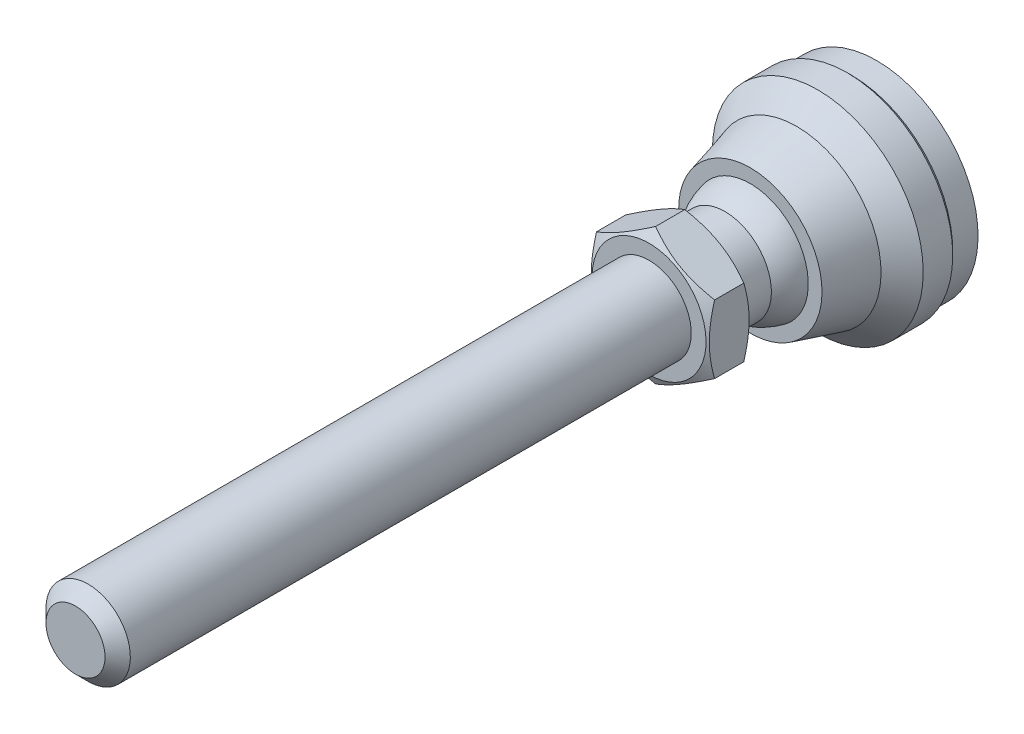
ISO-10303-21;
HEADER;
FILE_DESCRIPTION(('STEP AP214'),'2;1');
FILE_NAME('part.step','',(''),(''),'','','');
FILE_SCHEMA(('AUTOMOTIVE_DESIGN { 1 0 10303 214 1 1 1 1 }'));
ENDSEC;
DATA;
#1=APPLICATION_CONTEXT('core data for automotive mechanical design processes');
#2=APPLICATION_PROTOCOL_DEFINITION('international standard','automotive_design',2000,#1);
#3=PRODUCT_CONTEXT('',#1,'mechanical');
#4=PRODUCT('Part','Part','',(#3));
#5=PRODUCT_RELATED_PRODUCT_CATEGORY('part','',(#4));
#6=PRODUCT_DEFINITION_FORMATION('','',#4);
#7=PRODUCT_DEFINITION_CONTEXT('part definition',#1,'design');
#8=PRODUCT_DEFINITION('design','',#6,#7);
#9=PRODUCT_DEFINITION_SHAPE('','',#8);
#10=(LENGTH_UNIT() NAMED_UNIT(*) SI_UNIT(.MILLI.,.METRE.));
#11=(NAMED_UNIT(*) PLANE_ANGLE_UNIT() SI_UNIT($,.RADIAN.));
#12=(NAMED_UNIT(*) SI_UNIT($,.STERADIAN.) SOLID_ANGLE_UNIT());
#13=UNCERTAINTY_MEASURE_WITH_UNIT(LENGTH_MEASURE(1.E-05),#10,'distance_accuracy_value','');
#14=(GEOMETRIC_REPRESENTATION_CONTEXT(3) GLOBAL_UNCERTAINTY_ASSIGNED_CONTEXT((#13)) GLOBAL_UNIT_ASSIGNED_CONTEXT((#10,
#11,#12)) REPRESENTATION_CONTEXT('',''));
#15=CARTESIAN_POINT('',(0.,0.,0.));
#16=DIRECTION('',(0.,0.,1.));
#17=DIRECTION('',(1.,0.,0.));
#18=AXIS2_PLACEMENT_3D('',#15,#16,#17);
#19=CARTESIAN_POINT('',(-5.49999999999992,0.,21.9999999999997));
#20=DIRECTION('',(0.,0.,1.));
#21=DIRECTION('',(0.,-1.,0.));
#22=AXIS2_PLACEMENT_3D('',#19,#20,#21);
#23=PLANE('',#22);
#24=CARTESIAN_POINT('',(0.,0.,21.9999999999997));
#25=DIRECTION('',(0.,0.,1.));
#26=DIRECTION('',(0.,-1.,0.));
#27=AXIS2_PLACEMENT_3D('',#24,#25,#26);
#28=CIRCLE('',#27,6.75);
#29=CARTESIAN_POINT('',(0.,-6.75,21.9999999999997));
#30=VERTEX_POINT('',#29);
#31=EDGE_CURVE('E440',#30,#30,#28,.T.);
#32=ORIENTED_EDGE('',*,*,#31,.F.);
#33=EDGE_LOOP('',(#32));
#34=FACE_BOUND('',#33,.T.);
#35=CARTESIAN_POINT('',(0.,0.,21.9999999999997));
#36=DIRECTION('',(0.,0.,-1.));
#37=DIRECTION('',(0.,1.,0.));
#38=AXIS2_PLACEMENT_3D('',#35,#36,#37);
#39=CIRCLE('',#38,5.49999999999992);
#40=CARTESIAN_POINT('',(0.,5.49999999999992,21.9999999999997));
#41=VERTEX_POINT('',#40);
#42=EDGE_CURVE('E120',#41,#41,#39,.T.);
#43=ORIENTED_EDGE('',*,*,#42,.F.);
#44=EDGE_LOOP('',(#43));
#45=FACE_BOUND('',#44,.T.);
#46=ADVANCED_FACE('F14',(#34,#45),#23,.F.);
#47=CARTESIAN_POINT('',(0.,0.,0.));
#48=DIRECTION('',(0.,0.,-1.));
#49=DIRECTION('',(0.,1.,0.));
#50=AXIS2_PLACEMENT_3D('',#47,#48,#49);
#51=CYLINDRICAL_SURFACE('',#50,5.49999999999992);
#52=CARTESIAN_POINT('',(0.,0.,18.));
#53=DIRECTION('',(0.,0.,-1.));
#54=DIRECTION('',(0.,1.,0.));
#55=AXIS2_PLACEMENT_3D('',#52,#53,#54);
#56=CIRCLE('',#55,5.49999999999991);
#57=CARTESIAN_POINT('',(-5.49999999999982,0.,18.));
#58=VERTEX_POINT('',#57);
#59=EDGE_CURVE('E117',#58,#58,#56,.T.);
#60=ORIENTED_EDGE('',*,*,#59,.F.);
#61=EDGE_LOOP('',(#60));
#62=FACE_BOUND('',#61,.T.);
#63=ORIENTED_EDGE('',*,*,#42,.T.);
#64=EDGE_LOOP('',(#63));
#65=FACE_BOUND('',#64,.T.);
#66=ADVANCED_FACE('F144',(#62,#65),#51,.T.);
#67=CARTESIAN_POINT('',(0.,0.,13.6698729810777));
#68=DIRECTION('',(0.,0.,-1.));
#69=DIRECTION('',(-1.,0.,0.));
#70=AXIS2_PLACEMENT_3D('',#67,#68,#69);
#71=SPHERICAL_SURFACE('',#70,7.);
#72=CARTESIAN_POINT('',(0.,0.,15.));
#73=DIRECTION('',(0.,0.,-1.));
#74=DIRECTION('',(0.,1.,0.));
#75=AXIS2_PLACEMENT_3D('',#72,#73,#74);
#76=CIRCLE('',#75,6.87246404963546);
#77=CARTESIAN_POINT('',(-6.87246404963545,0.,15.));
#78=VERTEX_POINT('',#77);
#79=EDGE_CURVE('E114',#78,#78,#76,.T.);
#80=CARTESIAN_POINT('',(-6.87246404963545,0.,15.));
#81=CARTESIAN_POINT('',(-6.86587210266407,0.,15.0340591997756));
#82=CARTESIAN_POINT('',(-6.85902692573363,0.,15.0680693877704));
#83=CARTESIAN_POINT('',(-6.84483171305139,0.,15.1359842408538));
#84=CARTESIAN_POINT('',(-6.83748167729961,0.,15.1698889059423));
#85=CARTESIAN_POINT('',(-6.82227834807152,0.,15.2375852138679));
#86=CARTESIAN_POINT('',(-6.81442505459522,0.,15.2713768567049));
#87=CARTESIAN_POINT('',(-6.79821695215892,0.,15.3388396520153));
#88=CARTESIAN_POINT('',(-6.78986214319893,0.,15.3725108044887));
#89=CARTESIAN_POINT('',(-6.77265285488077,0.,15.4397251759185));
#90=CARTESIAN_POINT('',(-6.7637983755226,0.,15.473268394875));
#91=CARTESIAN_POINT('',(-6.74559170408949,0.,15.5402194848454));
#92=CARTESIAN_POINT('',(-6.73623951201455,0.,15.5736273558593));
#93=CARTESIAN_POINT('',(-6.71703948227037,0.,15.6403003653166));
#94=CARTESIAN_POINT('',(-6.70719164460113,0.,15.67356550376));
#95=CARTESIAN_POINT('',(-6.68700250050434,0.,15.7399456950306));
#96=CARTESIAN_POINT('',(-6.67666119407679,0.,15.7730607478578));
#97=CARTESIAN_POINT('',(-6.65548739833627,0.,15.8391334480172));
#98=CARTESIAN_POINT('',(-6.64465490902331,0.,15.8720910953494));
#99=CARTESIAN_POINT('',(-6.62250114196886,0.,15.9378416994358));
#100=CARTESIAN_POINT('',(-6.61117986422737,0.,15.9706346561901));
#101=CARTESIAN_POINT('',(-6.58805102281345,0.,16.0360486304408));
#102=CARTESIAN_POINT('',(-6.57624345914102,0.,16.0686696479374));
#103=CARTESIAN_POINT('',(-6.55214465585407,0.,16.1337325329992));
#104=CARTESIAN_POINT('',(-6.53985341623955,0.,16.1661744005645));
#105=CARTESIAN_POINT('',(-6.51478997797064,0.,16.2308718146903));
#106=CARTESIAN_POINT('',(-6.50201777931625,0.,16.2631273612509));
#107=CARTESIAN_POINT('',(-6.47599524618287,0.,16.3274450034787));
#108=CARTESIAN_POINT('',(-6.46274491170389,0.,16.3595070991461));
#109=CARTESIAN_POINT('',(-6.43576903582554,0.,16.4234307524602));
#110=CARTESIAN_POINT('',(-6.42204349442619,0.,16.455292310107));
#111=CARTESIAN_POINT('',(-6.39412023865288,0.,16.5188078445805));
#112=CARTESIAN_POINT('',(-6.37992252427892,0.,16.5504618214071));
#113=CARTESIAN_POINT('',(-6.35105806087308,0.,16.6135551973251));
#114=CARTESIAN_POINT('',(-6.33639131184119,0.,16.6449945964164));
#115=CARTESIAN_POINT('',(-6.30659202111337,0.,16.7076518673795));
#116=CARTESIAN_POINT('',(-6.29145947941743,0.,16.7388697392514));
#117=CARTESIAN_POINT('',(-6.26073194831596,0.,16.8010770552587));
#118=CARTESIAN_POINT('',(-6.24513695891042,0.,16.8320664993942));
#119=CARTESIAN_POINT('',(-6.2134879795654,0.,16.8938101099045));
#120=CARTESIAN_POINT('',(-6.19743398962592,0.,16.9245642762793));
#121=CARTESIAN_POINT('',(-6.16487055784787,0.,16.9858305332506));
#122=CARTESIAN_POINT('',(-6.1483611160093,0.,17.016342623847));
#123=CARTESIAN_POINT('',(-6.1148904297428,0.,17.0771179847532));
#124=CARTESIAN_POINT('',(-6.09792918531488,0.,17.107381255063));
#125=CARTESIAN_POINT('',(-6.06355864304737,0.,17.1676522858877));
#126=CARTESIAN_POINT('',(-6.04614934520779,0.,17.1976600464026));
#127=CARTESIAN_POINT('',(-6.01088654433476,0.,17.2574134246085));
#128=CARTESIAN_POINT('',(-5.99303304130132,0.,17.2871590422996));
#129=CARTESIAN_POINT('',(-5.95688577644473,0.,17.3463815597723));
#130=CARTESIAN_POINT('',(-5.93859201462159,0.,17.3758584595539));
#131=CARTESIAN_POINT('',(-5.90156827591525,0.,17.4345370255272));
#132=CARTESIAN_POINT('',(-5.88283829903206,0.,17.4637386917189));
#133=CARTESIAN_POINT('',(-5.84494627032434,0.,17.5218603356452));
#134=CARTESIAN_POINT('',(-5.82578421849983,0.,17.5507803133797));
#135=CARTESIAN_POINT('',(-5.78703227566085,0.,17.6083321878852));
#136=CARTESIAN_POINT('',(-5.76744238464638,0.,17.6369640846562));
#137=CARTESIAN_POINT('',(-5.72783909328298,0.,17.6939334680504));
#138=CARTESIAN_POINT('',(-5.70782569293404,0.,17.7222709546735));
#139=CARTESIAN_POINT('',(-5.66737980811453,0.,17.778645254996));
#140=CARTESIAN_POINT('',(-5.64694732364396,0.,17.8066820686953));
#141=CARTESIAN_POINT('',(-5.60566778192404,0.,17.862448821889));
#142=CARTESIAN_POINT('',(-5.5848207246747,0.,17.8901787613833));
#143=CARTESIAN_POINT('',(-5.54271666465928,0.,17.9453256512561));
#144=CARTESIAN_POINT('',(-5.52145966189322,0.,17.9727426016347));
#145=CARTESIAN_POINT('',(-5.49999999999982,0.,18.));
#146=B_SPLINE_CURVE_WITH_KNOTS('',3,(#80,#81,#82,#83,#84,#85,#86,#87,#88,#89,#90,#91,#92,#93,
#94,#95,#96,#97,#98,#99,#100,#101,#102,#103,#104,#105,#106,#107,#108,#109,#110,#111,#112,#113,
#114,#115,#116,#117,#118,#119,#120,#121,#122,#123,#124,#125,#126,#127,#128,#129,#130,#131,#132,
#133,#134,#135,#136,#137,#138,#139,#140,#141,#142,#143,#144,#145),.UNSPECIFIED.,.F.,.F.,(4,2,2,
2,2,2,2,2,2,2,2,2,2,2,2,2,2,2,2,2,2,2,2,2,2,2,2,2,2,2,2,2,4),(0.,0.104072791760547,
0.208145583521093,0.31221837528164,0.416291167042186,0.520363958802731,0.624436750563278,
0.728509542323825,0.832582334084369,0.936655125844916,1.04072791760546,1.14480070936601,
1.24887350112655,1.3529462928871,1.45701908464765,1.56109187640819,1.66516466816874,
1.76923745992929,1.87331025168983,1.97738304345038,2.08145583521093,2.18552862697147,
2.28960141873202,2.39367421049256,2.49774700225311,2.60181979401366,2.7058925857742,
2.80996537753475,2.9140381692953,3.01811096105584,3.12218375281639,3.22625654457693,
3.33032933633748),.UNSPECIFIED.);
#147=EDGE_CURVE('BSEAM151',#78,#58,#146,.T.);
#148=ORIENTED_EDGE('',*,*,#79,.F.);
#149=ORIENTED_EDGE('',*,*,#59,.T.);
#150=ORIENTED_EDGE('',*,*,#147,.T.);
#151=ORIENTED_EDGE('',*,*,#147,.F.);
#152=EDGE_LOOP('',(#148,#150,#149,#151));
#153=FACE_BOUND('',#152,.T.);
#154=ADVANCED_FACE('F151',(#153),#71,.T.);
#155=CARTESIAN_POINT('',(-8.5,0.,15.));
#156=DIRECTION('',(0.,0.,-1.));
#157=DIRECTION('',(0.,1.,0.));
#158=AXIS2_PLACEMENT_3D('',#155,#156,#157);
#159=PLANE('',#158);
#160=CARTESIAN_POINT('',(0.,0.,15.));
#161=DIRECTION('',(0.,0.,-1.));
#162=DIRECTION('',(0.,1.,0.));
#163=AXIS2_PLACEMENT_3D('',#160,#161,#162);
#164=CIRCLE('',#163,8.5);
#165=CARTESIAN_POINT('',(0.,8.5,15.));
#166=VERTEX_POINT('',#165);
#167=EDGE_CURVE('E111',#166,#166,#164,.T.);
#168=ORIENTED_EDGE('',*,*,#167,.F.);
#169=EDGE_LOOP('',(#168));
#170=FACE_BOUND('',#169,.T.);
#171=ORIENTED_EDGE('',*,*,#79,.T.);
#172=EDGE_LOOP('',(#171));
#173=FACE_BOUND('',#172,.T.);
#174=ADVANCED_FACE('F303',(#170,#173),#159,.F.);
#175=CARTESIAN_POINT('',(0.,0.,15.));
#176=DIRECTION('',(0.,0.,-1.));
#177=DIRECTION('',(0.,1.,0.));
#178=AXIS2_PLACEMENT_3D('',#175,#176,#177);
#179=CONICAL_SURFACE('',#178,8.5,0.266252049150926);
#180=CARTESIAN_POINT('',(0.,0.,9.49999999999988));
#181=DIRECTION('',(0.,0.,-1.));
#182=DIRECTION('',(0.,1.,0.));
#183=AXIS2_PLACEMENT_3D('',#180,#181,#182);
#184=CIRCLE('',#183,10.);
#185=CARTESIAN_POINT('',(0.,10.,9.49999999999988));
#186=VERTEX_POINT('',#185);
#187=EDGE_CURVE('E108',#186,#186,#184,.T.);
#188=ORIENTED_EDGE('',*,*,#187,.F.);
#189=EDGE_LOOP('',(#188));
#190=FACE_BOUND('',#189,.T.);
#191=ORIENTED_EDGE('',*,*,#167,.T.);
#192=EDGE_LOOP('',(#191));
#193=FACE_BOUND('',#192,.T.);
#194=ADVANCED_FACE('F293',(#190,#193),#179,.T.);
#195=CARTESIAN_POINT('',(0.,0.,9.49999999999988));
#196=DIRECTION('',(0.,0.,-1.));
#197=DIRECTION('',(0.,1.,0.));
#198=AXIS2_PLACEMENT_3D('',#195,#196,#197);
#199=CONICAL_SURFACE('',#198,10.,0.785398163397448);
#200=CARTESIAN_POINT('',(0.,0.,6.99999999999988));
#201=DIRECTION('',(0.,0.,-1.));
#202=DIRECTION('',(0.,1.,0.));
#203=AXIS2_PLACEMENT_3D('',#200,#201,#202);
#204=CIRCLE('',#203,12.5);
#205=CARTESIAN_POINT('',(0.,12.5,6.99999999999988));
#206=VERTEX_POINT('',#205);
#207=EDGE_CURVE('E105',#206,#206,#204,.T.);
#208=ORIENTED_EDGE('',*,*,#207,.F.);
#209=EDGE_LOOP('',(#208));
#210=FACE_BOUND('',#209,.T.);
#211=ORIENTED_EDGE('',*,*,#187,.T.);
#212=EDGE_LOOP('',(#211));
#213=FACE_BOUND('',#212,.T.);
#214=ADVANCED_FACE('F283',(#210,#213),#199,.T.);
#215=CARTESIAN_POINT('',(0.,0.,0.));
#216=DIRECTION('',(0.,0.,-1.));
#217=DIRECTION('',(0.,1.,0.));
#218=AXIS2_PLACEMENT_3D('',#215,#216,#217);
#219=CYLINDRICAL_SURFACE('',#218,12.5);
#220=CARTESIAN_POINT('',(0.,0.,3.49999999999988));
#221=DIRECTION('',(0.,0.,-1.));
#222=DIRECTION('',(0.,1.,0.));
#223=AXIS2_PLACEMENT_3D('',#220,#221,#222);
#224=CIRCLE('',#223,12.5);
#225=CARTESIAN_POINT('',(0.,12.5,3.49999999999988));
#226=VERTEX_POINT('',#225);
#227=EDGE_CURVE('E102',#226,#226,#224,.T.);
#228=ORIENTED_EDGE('',*,*,#227,.F.);
#229=EDGE_LOOP('',(#228));
#230=FACE_BOUND('',#229,.T.);
#231=ORIENTED_EDGE('',*,*,#207,.T.);
#232=EDGE_LOOP('',(#231));
#233=FACE_BOUND('',#232,.T.);
#234=ADVANCED_FACE('F273',(#230,#233),#219,.T.);
#235=CARTESIAN_POINT('',(0.,0.,3.49999999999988));
#236=DIRECTION('',(0.,0.,1.));
#237=DIRECTION('',(0.,-1.,0.));
#238=AXIS2_PLACEMENT_3D('',#235,#236,#237);
#239=CONICAL_SURFACE('',#238,12.5,0.785398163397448);
#240=CARTESIAN_POINT('',(0.,0.,2.99999999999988));
#241=DIRECTION('',(0.,0.,-1.));
#242=DIRECTION('',(0.,1.,0.));
#243=AXIS2_PLACEMENT_3D('',#240,#241,#242);
#244=CIRCLE('',#243,12.);
#245=CARTESIAN_POINT('',(0.,12.,2.99999999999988));
#246=VERTEX_POINT('',#245);
#247=EDGE_CURVE('E99',#246,#246,#244,.T.);
#248=ORIENTED_EDGE('',*,*,#247,.F.);
#249=EDGE_LOOP('',(#248));
#250=FACE_BOUND('',#249,.T.);
#251=ORIENTED_EDGE('',*,*,#227,.T.);
#252=EDGE_LOOP('',(#251));
#253=FACE_BOUND('',#252,.T.);
#254=ADVANCED_FACE('F263',(#250,#253),#239,.T.);
#255=CARTESIAN_POINT('',(0.,0.,0.));
#256=DIRECTION('',(0.,0.,-1.));
#257=DIRECTION('',(0.,1.,0.));
#258=AXIS2_PLACEMENT_3D('',#255,#256,#257);
#259=CYLINDRICAL_SURFACE('',#258,12.);
#260=CARTESIAN_POINT('',(0.,0.,0.));
#261=DIRECTION('',(0.,0.,-1.));
#262=DIRECTION('',(0.,1.,0.));
#263=AXIS2_PLACEMENT_3D('',#260,#261,#262);
#264=CIRCLE('',#263,12.);
#265=CARTESIAN_POINT('',(0.,12.,0.));
#266=VERTEX_POINT('',#265);
#267=EDGE_CURVE('E96',#266,#266,#264,.T.);
#268=ORIENTED_EDGE('',*,*,#267,.F.);
#269=EDGE_LOOP('',(#268));
#270=FACE_BOUND('',#269,.T.);
#271=ORIENTED_EDGE('',*,*,#247,.T.);
#272=EDGE_LOOP('',(#271));
#273=FACE_BOUND('',#272,.T.);
#274=ADVANCED_FACE('F252',(#270,#273),#259,.T.);
#275=CARTESIAN_POINT('',(-12.,0.,0.));
#276=DIRECTION('',(0.,0.,1.));
#277=DIRECTION('',(0.,-1.,0.));
#278=AXIS2_PLACEMENT_3D('',#275,#276,#277);
#279=PLANE('',#278);
#280=ORIENTED_EDGE('',*,*,#267,.T.);
#281=EDGE_LOOP('',(#280));
#282=FACE_BOUND('',#281,.T.);
#283=ADVANCED_FACE('F142',(#282),#279,.F.);
#284=CARTESIAN_POINT('',(0.,0.,21.9999999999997));
#285=DIRECTION('',(0.,0.,1.));
#286=DIRECTION('',(0.,-1.,0.));
#287=AXIS2_PLACEMENT_3D('',#284,#285,#286);
#288=CONICAL_SURFACE('',#287,6.75,1.0471975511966);
#289=CARTESIAN_POINT('',(0.000200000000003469,-8.0830192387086,22.7696190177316));
#290=CARTESIAN_POINT('',(-0.15366790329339,-7.99418356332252,22.7183374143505));
#291=CARTESIAN_POINT('',(-0.308109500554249,-7.90501666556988,22.6693831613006));
#292=CARTESIAN_POINT('',(-0.618246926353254,-7.72595873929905,22.5767703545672));
#293=CARTESIAN_POINT('',(-0.773943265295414,-7.63606741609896,22.5331140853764));
#294=CARTESIAN_POINT('',(-1.24352516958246,-7.36495417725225,22.4109491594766));
#295=CARTESIAN_POINT('',(-1.5592643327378,-7.18266208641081,22.341463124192));
#296=CARTESIAN_POINT('',(-2.03176224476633,-6.90986528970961,22.2599825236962));
#297=CARTESIAN_POINT('',(-2.18710922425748,-6.82017566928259,22.2367710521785));
#298=CARTESIAN_POINT('',(-2.49850511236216,-6.64039116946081,22.1978487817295));
#299=CARTESIAN_POINT('',(-2.65455395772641,-6.55029632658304,22.1821373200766));
#300=CARTESIAN_POINT('',(-2.96692267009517,-6.36995016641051,22.1586154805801));
#301=CARTESIAN_POINT('',(-3.12324202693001,-6.27969914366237,22.1507961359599));
#302=CARTESIAN_POINT('',(-3.43601650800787,-6.09911871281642,22.1432178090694));
#303=CARTESIAN_POINT('',(-3.59247162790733,-6.00878930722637,22.143458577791));
#304=CARTESIAN_POINT('',(-4.02110687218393,-5.76131663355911,22.1551972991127));
#305=CARTESIAN_POINT('',(-4.2931466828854,-5.60425437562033,22.17490331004));
#306=CARTESIAN_POINT('',(-4.8354194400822,-5.29117305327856,22.2373910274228));
#307=CARTESIAN_POINT('',(-5.10565047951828,-5.13515508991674,22.28019409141));
#308=CARTESIAN_POINT('',(-5.64901454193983,-4.82144370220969,22.3871892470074));
#309=CARTESIAN_POINT('',(-5.92207900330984,-4.6637898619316,22.4518346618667));
#310=CARTESIAN_POINT('',(-6.46413578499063,-4.35083323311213,22.5985536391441));
#311=CARTESIAN_POINT('',(-6.73313504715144,-4.19552643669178,22.6805927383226));
#312=CARTESIAN_POINT('',(-7.0002,-4.04133641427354,22.7696190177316));
#313=B_SPLINE_CURVE_WITH_KNOTS('',3,(#289,#290,#291,#292,#293,#294,#295,#296,#297,#298,#299,
#300,#301,#302,#303,#304,#305,#306,#307,#308,#309,#310,#311,#312),.UNSPECIFIED.,.F.,.F.,(4,2,2,
2,2,2,2,2,2,2,2,4),(0.,0.554727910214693,1.10969417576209,2.2219327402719,2.76443041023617,
3.30688013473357,3.8487128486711,4.39052882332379,5.33376515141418,6.27787517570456,
7.2429241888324,8.20607866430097),.UNSPECIFIED.);
#314=CARTESIAN_POINT('',(0.,-8.08290376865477,22.7695523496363));
#315=VERTEX_POINT('',#314);
#316=CARTESIAN_POINT('',(-7.,-4.04145188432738,22.7695523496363));
#317=VERTEX_POINT('',#316);
#318=EDGE_CURVE('E73',#315,#317,#313,.T.);
#319=ORIENTED_EDGE('',*,*,#318,.T.);
#320=CARTESIAN_POINT('',(-7.,10.8555954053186,25.5604087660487));
#321=CARTESIAN_POINT('',(-7.,10.549860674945,25.4121009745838));
#322=CARTESIAN_POINT('',(-7.,10.2434240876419,25.265215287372));
#323=CARTESIAN_POINT('',(-7.,9.62877393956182,24.9750879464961));
#324=CARTESIAN_POINT('',(-7.,9.32056010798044,24.8318468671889));
#325=CARTESIAN_POINT('',(-7.,8.70039411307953,24.5490878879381));
#326=CARTESIAN_POINT('',(-7.,8.38843073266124,24.4095945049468));
#327=CARTESIAN_POINT('',(-7.,7.76202268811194,24.1363165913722));
#328=CARTESIAN_POINT('',(-7.,7.44757814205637,24.0025317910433));
#329=CARTESIAN_POINT('',(-7.,6.8055599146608,23.7379970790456));
#330=CARTESIAN_POINT('',(-7.,6.47788877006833,23.6074823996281));
#331=CARTESIAN_POINT('',(-7.,5.81871366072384,23.3563314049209));
#332=CARTESIAN_POINT('',(-7.,5.48720927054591,23.2356961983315));
#333=CARTESIAN_POINT('',(-7.,4.82045679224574,23.0074715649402));
#334=CARTESIAN_POINT('',(-7.,4.48521784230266,22.8998557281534));
#335=CARTESIAN_POINT('',(-7.,3.8099431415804,22.7011217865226));
#336=CARTESIAN_POINT('',(-7.,3.46990893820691,22.6099984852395));
#337=CARTESIAN_POINT('',(-7.,2.78668091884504,22.4491133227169));
#338=CARTESIAN_POINT('',(-7.,2.4435151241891,22.3792356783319));
#339=CARTESIAN_POINT('',(-7.,1.92564161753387,22.2933788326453));
#340=CARTESIAN_POINT('',(-7.,1.75248360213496,22.2679186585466));
#341=CARTESIAN_POINT('',(-7.,1.40530696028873,22.2238175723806));
#342=CARTESIAN_POINT('',(-7.,1.23128841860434,22.2051760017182));
#343=CARTESIAN_POINT('',(-7.,0.884897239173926,22.1753173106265));
#344=CARTESIAN_POINT('',(-7.,0.712532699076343,22.1640066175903));
#345=CARTESIAN_POINT('',(-7.,0.367479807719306,22.1486841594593));
#346=CARTESIAN_POINT('',(-7.,0.194791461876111,22.1446722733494));
#347=CARTESIAN_POINT('',(-7.,-0.15060040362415,22.1440431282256));
#348=CARTESIAN_POINT('',(-7.,-0.32330392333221,22.1474258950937));
#349=CARTESIAN_POINT('',(-7.,-0.668414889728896,22.1615034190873));
#350=CARTESIAN_POINT('',(-7.,-0.840822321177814,22.1721985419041));
#351=CARTESIAN_POINT('',(-7.,-1.25517349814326,22.206463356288));
#352=CARTESIAN_POINT('',(-7.,-1.49683636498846,22.2335027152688));
#353=CARTESIAN_POINT('',(-7.,-1.9783569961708,22.3004731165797));
#354=CARTESIAN_POINT('',(-7.,-2.21821451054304,22.3404059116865));
#355=CARTESIAN_POINT('',(-7.,-2.9348111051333,22.4774260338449));
#356=CARTESIAN_POINT('',(-7.,-3.40830490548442,22.5917098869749));
#357=CARTESIAN_POINT('',(-7.,-4.11630759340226,22.7897489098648));
#358=CARTESIAN_POINT('',(-7.,-4.35449228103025,22.8611174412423));
#359=CARTESIAN_POINT('',(-7.,-4.82854798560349,23.0112325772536));
#360=CARTESIAN_POINT('',(-7.,-5.06441898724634,23.0899792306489));
#361=CARTESIAN_POINT('',(-7.,-5.53392220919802,23.2535899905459));
#362=CARTESIAN_POINT('',(-7.,-5.76755514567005,23.3384520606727));
#363=CARTESIAN_POINT('',(-7.,-6.23288756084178,23.5132985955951));
#364=CARTESIAN_POINT('',(-7.,-6.46458706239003,23.6032829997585));
#365=CARTESIAN_POINT('',(-7.,-7.01222232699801,23.8218242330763));
#366=CARTESIAN_POINT('',(-7.,-7.32740334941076,23.9522688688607));
#367=CARTESIAN_POINT('',(-7.,-7.95507954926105,24.2194859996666));
#368=CARTESIAN_POINT('',(-7.,-8.26757455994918,24.3562588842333));
#369=CARTESIAN_POINT('',(-7.,-8.89037429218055,24.6348583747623));
#370=CARTESIAN_POINT('',(-7.,-9.20067855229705,24.7766860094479));
#371=CARTESIAN_POINT('',(-7.,-9.81941217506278,25.064380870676));
#372=CARTESIAN_POINT('',(-7.,-10.1278414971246,25.2102481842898));
#373=CARTESIAN_POINT('',(-7.,-10.7434582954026,25.505418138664));
#374=CARTESIAN_POINT('',(-7.,-11.0506440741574,25.6547243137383));
#375=CARTESIAN_POINT('',(-7.,-11.6636904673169,25.9560353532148));
#376=CARTESIAN_POINT('',(-7.,-11.969551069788,26.108040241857));
#377=CARTESIAN_POINT('',(-7.,-12.8853802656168,26.5673425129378));
#378=CARTESIAN_POINT('',(-7.,-13.4936796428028,26.877967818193));
#379=CARTESIAN_POINT('',(-7.,-14.6559518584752,27.4790309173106));
#380=CARTESIAN_POINT('',(-7.,-15.2101858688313,27.76896594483));
#381=CARTESIAN_POINT('',(-7.,-16.316597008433,28.3527792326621));
#382=CARTESIAN_POINT('',(-7.,-16.8687740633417,28.6466576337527));
#383=CARTESIAN_POINT('',(-7.,-17.9701406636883,29.2366749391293));
#384=CARTESIAN_POINT('',(-7.,-18.5193342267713,29.5328063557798));
#385=CARTESIAN_POINT('',(-7.,-19.6164069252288,30.1274226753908));
#386=CARTESIAN_POINT('',(-7.,-20.1642861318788,30.4259074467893));
#387=CARTESIAN_POINT('',(-7.,-20.7116819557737,30.7252701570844));
#388=B_SPLINE_CURVE_WITH_KNOTS('',3,(#320,#321,#322,#323,#324,#325,#326,#327,#328,#329,#330,
#331,#332,#333,#334,#335,#336,#337,#338,#339,#340,#341,#342,#343,#344,#345,#346,#347,#348,#349,
#350,#351,#352,#353,#354,#355,#356,#357,#358,#359,#360,#361,#362,#363,#364,#365,#366,#367,#368,
#369,#370,#371,#372,#373,#374,#375,#376,#377,#378,#379,#380,#381,#382,#383,#384,#385,#386,#387),
.UNSPECIFIED.,.F.,.F.,(4,2,2,2,2,2,2,2,2,2,2,2,2,2,2,2,2,2,2,2,2,2,2,2,2,2,2,2,2,2,2,2,2,4),(0.,
1.01943401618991,2.03902770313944,3.06417258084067,4.08926896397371,5.14726733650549,
6.20538427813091,7.2613174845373,8.3169174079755,9.3666569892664,9.89160316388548,
10.4164986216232,10.9345549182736,11.4526026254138,11.9706521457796,12.4887275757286,
13.2178281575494,13.9470278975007,15.4062352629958,16.1521148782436,16.8979994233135,
17.6436367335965,18.3892652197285,19.4124967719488,20.435791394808,21.4592954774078,
22.4828216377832,23.5074513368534,24.5320902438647,26.5810901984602,28.4575431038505,
30.3340631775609,32.2058921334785,34.0776171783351),.UNSPECIFIED.);
#389=CARTESIAN_POINT('',(-7.,4.04145188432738,22.7695523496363));
#390=VERTEX_POINT('',#389);
#391=EDGE_CURVE('E81',#317,#390,#388,.F.);
#392=ORIENTED_EDGE('',*,*,#391,.T.);
#393=CARTESIAN_POINT('',(-7.0002,4.04133641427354,22.7696190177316));
#394=CARTESIAN_POINT('',(-6.84633209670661,4.13017208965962,22.7183374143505));
#395=CARTESIAN_POINT('',(-6.69189049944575,4.21933898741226,22.6693831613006));
#396=CARTESIAN_POINT('',(-6.38175307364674,4.39839691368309,22.5767703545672));
#397=CARTESIAN_POINT('',(-6.22605673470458,4.48828823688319,22.5331140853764));
#398=CARTESIAN_POINT('',(-5.75647483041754,4.75940147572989,22.4109491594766));
#399=CARTESIAN_POINT('',(-5.4407356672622,4.94169356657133,22.341463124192));
#400=CARTESIAN_POINT('',(-4.96823775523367,5.21449036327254,22.2599825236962));
#401=CARTESIAN_POINT('',(-4.81289077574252,5.30417998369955,22.2367710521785));
#402=CARTESIAN_POINT('',(-4.50149488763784,5.48396448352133,22.1978487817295));
#403=CARTESIAN_POINT('',(-4.34544604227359,5.57405932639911,22.1821373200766));
#404=CARTESIAN_POINT('',(-4.03307732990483,5.75440548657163,22.1586154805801));
#405=CARTESIAN_POINT('',(-3.87675797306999,5.84465650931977,22.1507961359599));
#406=CARTESIAN_POINT('',(-3.56398349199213,6.02523694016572,22.1432178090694));
#407=CARTESIAN_POINT('',(-3.40752837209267,6.11556634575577,22.143458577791));
#408=CARTESIAN_POINT('',(-2.97889312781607,6.36303901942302,22.1551972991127));
#409=CARTESIAN_POINT('',(-2.7068533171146,6.52010127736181,22.17490331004));
#410=CARTESIAN_POINT('',(-2.16458055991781,6.83318259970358,22.2373910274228));
#411=CARTESIAN_POINT('',(-1.89434952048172,6.9892005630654,22.28019409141));
#412=CARTESIAN_POINT('',(-1.35098545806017,7.30291195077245,22.3871892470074));
#413=CARTESIAN_POINT('',(-1.07792099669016,7.46056579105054,22.4518346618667));
#414=CARTESIAN_POINT('',(-0.535864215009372,7.77352241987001,22.5985536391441));
#415=CARTESIAN_POINT('',(-0.266864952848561,7.92882921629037,22.6805927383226));
#416=CARTESIAN_POINT('',(0.000199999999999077,8.0830192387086,22.7696190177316));
#417=B_SPLINE_CURVE_WITH_KNOTS('',3,(#393,#394,#395,#396,#397,#398,#399,#400,#401,#402,#403,
#404,#405,#406,#407,#408,#409,#410,#411,#412,#413,#414,#415,#416),.UNSPECIFIED.,.F.,.F.,(4,2,2,
2,2,2,2,2,2,2,2,4),(0.,0.554727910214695,1.10969417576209,2.2219327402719,2.76443041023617,
3.30688013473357,3.84871284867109,4.39052882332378,5.33376515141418,6.27787517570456,
7.2429241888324,8.20607866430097),.UNSPECIFIED.);
#418=CARTESIAN_POINT('',(0.,8.08290376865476,22.7695523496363));
#419=VERTEX_POINT('',#418);
#420=EDGE_CURVE('E395',#390,#419,#417,.T.);
#421=ORIENTED_EDGE('',*,*,#420,.T.);
#422=CARTESIAN_POINT('',(-0.000200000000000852,8.0830192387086,22.7696190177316));
#423=CARTESIAN_POINT('',(0.153667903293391,7.99418356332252,22.7183374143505));
#424=CARTESIAN_POINT('',(0.30810950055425,7.90501666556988,22.6693831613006));
#425=CARTESIAN_POINT('',(0.618246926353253,7.72595873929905,22.5767703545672));
#426=CARTESIAN_POINT('',(0.773943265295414,7.63606741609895,22.5331140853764));
#427=CARTESIAN_POINT('',(1.24352516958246,7.36495417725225,22.4109491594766));
#428=CARTESIAN_POINT('',(1.5592643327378,7.18266208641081,22.341463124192));
#429=CARTESIAN_POINT('',(2.03176224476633,6.9098652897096,22.2599825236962));
#430=CARTESIAN_POINT('',(2.18710922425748,6.82017566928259,22.2367710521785));
#431=CARTESIAN_POINT('',(2.49850511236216,6.64039116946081,22.1978487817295));
#432=CARTESIAN_POINT('',(2.65455395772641,6.55029632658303,22.1821373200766));
#433=CARTESIAN_POINT('',(2.96692267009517,6.36995016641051,22.1586154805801));
#434=CARTESIAN_POINT('',(3.12324202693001,6.27969914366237,22.1507961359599));
#435=CARTESIAN_POINT('',(3.43601650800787,6.09911871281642,22.1432178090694));
#436=CARTESIAN_POINT('',(3.59247162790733,6.00878930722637,22.143458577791));
#437=CARTESIAN_POINT('',(4.02110687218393,5.76131663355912,22.1551972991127));
#438=CARTESIAN_POINT('',(4.2931466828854,5.60425437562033,22.17490331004));
#439=CARTESIAN_POINT('',(4.83541944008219,5.29117305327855,22.2373910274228));
#440=CARTESIAN_POINT('',(5.10565047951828,5.13515508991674,22.28019409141));
#441=CARTESIAN_POINT('',(5.64901454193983,4.82144370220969,22.3871892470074));
#442=CARTESIAN_POINT('',(5.92207900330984,4.66378986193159,22.4518346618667));
#443=CARTESIAN_POINT('',(6.46413578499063,4.35083323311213,22.5985536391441));
#444=CARTESIAN_POINT('',(6.73313504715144,4.19552643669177,22.6805927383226));
#445=CARTESIAN_POINT('',(7.0002,4.04133641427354,22.7696190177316));
#446=B_SPLINE_CURVE_WITH_KNOTS('',3,(#422,#423,#424,#425,#426,#427,#428,#429,#430,#431,#432,
#433,#434,#435,#436,#437,#438,#439,#440,#441,#442,#443,#444,#445),.UNSPECIFIED.,.F.,.F.,(4,2,2,
2,2,2,2,2,2,2,2,4),(0.,0.554727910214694,1.10969417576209,2.2219327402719,2.76443041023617,
3.30688013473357,3.8487128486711,4.39052882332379,5.33376515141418,6.27787517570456,
7.2429241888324,8.20607866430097),.UNSPECIFIED.);
#447=CARTESIAN_POINT('',(7.,4.04145188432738,22.7695523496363));
#448=VERTEX_POINT('',#447);
#449=EDGE_CURVE('E390',#419,#448,#446,.T.);
#450=ORIENTED_EDGE('',*,*,#449,.T.);
#451=CARTESIAN_POINT('',(7.,10.8555954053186,25.5604087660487));
#452=CARTESIAN_POINT('',(7.,10.549860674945,25.4121009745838));
#453=CARTESIAN_POINT('',(7.,10.2434240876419,25.265215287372));
#454=CARTESIAN_POINT('',(7.,9.62877393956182,24.9750879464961));
#455=CARTESIAN_POINT('',(7.,9.32056010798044,24.8318468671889));
#456=CARTESIAN_POINT('',(7.,8.70039411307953,24.5490878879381));
#457=CARTESIAN_POINT('',(7.,8.38843073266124,24.4095945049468));
#458=CARTESIAN_POINT('',(7.,7.76202268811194,24.1363165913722));
#459=CARTESIAN_POINT('',(7.,7.44757814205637,24.0025317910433));
#460=CARTESIAN_POINT('',(7.,6.80555991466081,23.7379970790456));
#461=CARTESIAN_POINT('',(7.,6.47788877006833,23.6074823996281));
#462=CARTESIAN_POINT('',(7.,5.81871366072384,23.3563314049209));
#463=CARTESIAN_POINT('',(7.,5.48720927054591,23.2356961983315));
#464=CARTESIAN_POINT('',(7.,4.82045679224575,23.0074715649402));
#465=CARTESIAN_POINT('',(7.,4.48521784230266,22.8998557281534));
#466=CARTESIAN_POINT('',(7.,3.8099431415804,22.7011217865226));
#467=CARTESIAN_POINT('',(7.,3.46990893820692,22.6099984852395));
#468=CARTESIAN_POINT('',(7.,2.78668091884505,22.4491133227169));
#469=CARTESIAN_POINT('',(7.,2.4435151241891,22.3792356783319));
#470=CARTESIAN_POINT('',(7.,1.92564161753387,22.2933788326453));
#471=CARTESIAN_POINT('',(7.,1.75248360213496,22.2679186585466));
#472=CARTESIAN_POINT('',(7.,1.40530696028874,22.2238175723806));
#473=CARTESIAN_POINT('',(7.,1.23128841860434,22.2051760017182));
#474=CARTESIAN_POINT('',(7.,0.884897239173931,22.1753173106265));
#475=CARTESIAN_POINT('',(7.,0.712532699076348,22.1640066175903));
#476=CARTESIAN_POINT('',(7.,0.367479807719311,22.1486841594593));
#477=CARTESIAN_POINT('',(7.,0.194791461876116,22.1446722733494));
#478=CARTESIAN_POINT('',(7.,-0.150600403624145,22.1440431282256));
#479=CARTESIAN_POINT('',(7.,-0.323303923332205,22.1474258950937));
#480=CARTESIAN_POINT('',(7.,-0.668414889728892,22.1615034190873));
#481=CARTESIAN_POINT('',(7.,-0.84082232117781,22.1721985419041));
#482=CARTESIAN_POINT('',(7.,-1.25517349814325,22.206463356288));
#483=CARTESIAN_POINT('',(7.,-1.49683636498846,22.2335027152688));
#484=CARTESIAN_POINT('',(7.,-1.9783569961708,22.3004731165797));
#485=CARTESIAN_POINT('',(7.,-2.21821451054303,22.3404059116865));
#486=CARTESIAN_POINT('',(7.,-2.93481110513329,22.4774260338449));
#487=CARTESIAN_POINT('',(7.,-3.40830490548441,22.5917098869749));
#488=CARTESIAN_POINT('',(7.,-4.11630759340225,22.7897489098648));
#489=CARTESIAN_POINT('',(7.,-4.35449228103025,22.8611174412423));
#490=CARTESIAN_POINT('',(7.,-4.82854798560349,23.0112325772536));
#491=CARTESIAN_POINT('',(7.,-5.06441898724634,23.0899792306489));
#492=CARTESIAN_POINT('',(7.,-5.53392220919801,23.2535899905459));
#493=CARTESIAN_POINT('',(7.,-5.76755514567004,23.3384520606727));
#494=CARTESIAN_POINT('',(7.,-6.23288756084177,23.5132985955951));
#495=CARTESIAN_POINT('',(7.,-6.46458706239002,23.6032829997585));
#496=CARTESIAN_POINT('',(7.,-7.012222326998,23.8218242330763));
#497=CARTESIAN_POINT('',(7.,-7.32740334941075,23.9522688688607));
#498=CARTESIAN_POINT('',(7.,-7.95507954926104,24.2194859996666));
#499=CARTESIAN_POINT('',(7.,-8.26757455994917,24.3562588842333));
#500=CARTESIAN_POINT('',(7.,-8.89037429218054,24.6348583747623));
#501=CARTESIAN_POINT('',(7.,-9.20067855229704,24.7766860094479));
#502=CARTESIAN_POINT('',(7.,-9.81941217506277,25.064380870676));
#503=CARTESIAN_POINT('',(7.,-10.1278414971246,25.2102481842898));
#504=CARTESIAN_POINT('',(7.,-10.7434582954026,25.505418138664));
#505=CARTESIAN_POINT('',(7.,-11.0506440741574,25.6547243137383));
#506=CARTESIAN_POINT('',(7.,-11.6636904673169,25.9560353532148));
#507=CARTESIAN_POINT('',(7.,-11.969551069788,26.108040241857));
#508=CARTESIAN_POINT('',(7.,-12.8853802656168,26.5673425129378));
#509=CARTESIAN_POINT('',(7.,-13.4936796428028,26.877967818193));
#510=CARTESIAN_POINT('',(7.,-14.6559518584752,27.4790309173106));
#511=CARTESIAN_POINT('',(7.,-15.2101858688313,27.76896594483));
#512=CARTESIAN_POINT('',(7.,-16.316597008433,28.3527792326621));
#513=CARTESIAN_POINT('',(7.,-16.8687740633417,28.6466576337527));
#514=CARTESIAN_POINT('',(7.,-17.9701406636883,29.2366749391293));
#515=CARTESIAN_POINT('',(7.,-18.5193342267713,29.5328063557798));
#516=CARTESIAN_POINT('',(7.,-19.6164069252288,30.1274226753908));
#517=CARTESIAN_POINT('',(7.,-20.1642861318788,30.4259074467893));
#518=CARTESIAN_POINT('',(7.,-20.7116819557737,30.7252701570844));
#519=B_SPLINE_CURVE_WITH_KNOTS('',3,(#451,#452,#453,#454,#455,#456,#457,#458,#459,#460,#461,
#462,#463,#464,#465,#466,#467,#468,#469,#470,#471,#472,#473,#474,#475,#476,#477,#478,#479,#480,
#481,#482,#483,#484,#485,#486,#487,#488,#489,#490,#491,#492,#493,#494,#495,#496,#497,#498,#499,
#500,#501,#502,#503,#504,#505,#506,#507,#508,#509,#510,#511,#512,#513,#514,#515,#516,#517,#518),
.UNSPECIFIED.,.F.,.F.,(4,2,2,2,2,2,2,2,2,2,2,2,2,2,2,2,2,2,2,2,2,2,2,2,2,2,2,2,2,2,2,2,2,4),(0.,
1.01943401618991,2.03902770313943,3.06417258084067,4.08926896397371,5.14726733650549,
6.20538427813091,7.2613174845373,8.3169174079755,9.3666569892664,9.89160316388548,
10.4164986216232,10.9345549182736,11.4526026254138,11.9706521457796,12.4887275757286,
13.2178281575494,13.9470278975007,15.4062352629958,16.1521148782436,16.8979994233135,
17.6436367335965,18.3892652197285,19.4124967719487,20.435791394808,21.4592954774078,
22.4828216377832,23.5074513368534,24.5320902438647,26.5810901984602,28.4575431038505,
30.3340631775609,32.2058921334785,34.0776171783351),.UNSPECIFIED.);
#520=CARTESIAN_POINT('',(7.,-4.04145188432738,22.7695523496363));
#521=VERTEX_POINT('',#520);
#522=EDGE_CURVE('E34',#448,#521,#519,.T.);
#523=ORIENTED_EDGE('',*,*,#522,.T.);
#524=CARTESIAN_POINT('',(7.0002,-4.04133641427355,22.7696190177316));
#525=CARTESIAN_POINT('',(6.84633209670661,-4.13017208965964,22.7183374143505));
#526=CARTESIAN_POINT('',(6.69189049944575,-4.21933898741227,22.6693831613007));
#527=CARTESIAN_POINT('',(6.38175307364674,-4.3983969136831,22.5767703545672));
#528=CARTESIAN_POINT('',(6.22605673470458,-4.4882882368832,22.5331140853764));
#529=CARTESIAN_POINT('',(5.75647483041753,-4.7594014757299,22.4109491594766));
#530=CARTESIAN_POINT('',(5.4407356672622,-4.94169356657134,22.341463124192));
#531=CARTESIAN_POINT('',(4.96823775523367,-5.21449036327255,22.2599825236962));
#532=CARTESIAN_POINT('',(4.81289077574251,-5.30417998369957,22.2367710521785));
#533=CARTESIAN_POINT('',(4.50149488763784,-5.48396448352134,22.1978487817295));
#534=CARTESIAN_POINT('',(4.34544604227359,-5.57405932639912,22.1821373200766));
#535=CARTESIAN_POINT('',(4.03307732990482,-5.75440548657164,22.1586154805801));
#536=CARTESIAN_POINT('',(3.87675797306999,-5.84465650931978,22.1507961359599));
#537=CARTESIAN_POINT('',(3.56398349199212,-6.02523694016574,22.1432178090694));
#538=CARTESIAN_POINT('',(3.40752837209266,-6.11556634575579,22.143458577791));
#539=CARTESIAN_POINT('',(2.97889312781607,-6.36303901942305,22.1551972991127));
#540=CARTESIAN_POINT('',(2.7068533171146,-6.52010127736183,22.17490331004));
#541=CARTESIAN_POINT('',(2.16458055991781,-6.83318259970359,22.2373910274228));
#542=CARTESIAN_POINT('',(1.89434952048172,-6.98920056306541,22.28019409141));
#543=CARTESIAN_POINT('',(1.35098545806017,-7.30291195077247,22.3871892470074));
#544=CARTESIAN_POINT('',(1.07792099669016,-7.46056579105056,22.4518346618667));
#545=CARTESIAN_POINT('',(0.535864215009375,-7.77352241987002,22.5985536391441));
#546=CARTESIAN_POINT('',(0.266864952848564,-7.92882921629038,22.6805927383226));
#547=CARTESIAN_POINT('',(-0.000199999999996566,-8.08301923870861,22.7696190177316));
#548=B_SPLINE_CURVE_WITH_KNOTS('',3,(#524,#525,#526,#527,#528,#529,#530,#531,#532,#533,#534,
#535,#536,#537,#538,#539,#540,#541,#542,#543,#544,#545,#546,#547),.UNSPECIFIED.,.F.,.F.,(4,2,2,
2,2,2,2,2,2,2,2,4),(0.,0.554727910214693,1.10969417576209,2.2219327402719,2.76443041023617,
3.30688013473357,3.8487128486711,4.39052882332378,5.33376515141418,6.27787517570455,
7.24292418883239,8.20607866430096),.UNSPECIFIED.);
#549=EDGE_CURVE('E9',#521,#315,#548,.T.);
#550=ORIENTED_EDGE('',*,*,#549,.T.);
#551=EDGE_LOOP('',(#319,#392,#421,#450,#523,#550));
#552=FACE_BOUND('',#551,.T.);
#553=ORIENTED_EDGE('',*,*,#31,.T.);
#554=EDGE_LOOP('',(#553));
#555=FACE_BOUND('',#554,.T.);
#556=ADVANCED_FACE('F71',(#552,#555),#288,.T.);
#557=CARTESIAN_POINT('',(-3.49999999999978,0.,95.));
#558=DIRECTION('',(0.,0.,-1.));
#559=DIRECTION('',(0.,1.,0.));
#560=AXIS2_PLACEMENT_3D('',#557,#558,#559);
#561=PLANE('',#560);
#562=CARTESIAN_POINT('',(0.,0.,95.));
#563=DIRECTION('',(0.,0.,-1.));
#564=DIRECTION('',(0.,1.,0.));
#565=AXIS2_PLACEMENT_3D('',#562,#563,#564);
#566=CIRCLE('',#565,3.49999999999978);
#567=CARTESIAN_POINT('',(0.,3.49999999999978,95.));
#568=VERTEX_POINT('',#567);
#569=EDGE_CURVE('E28',#568,#568,#566,.T.);
#570=ORIENTED_EDGE('',*,*,#569,.F.);
#571=EDGE_LOOP('',(#570));
#572=FACE_BOUND('',#571,.T.);
#573=ADVANCED_FACE('F16',(#572),#561,.F.);
#574=CARTESIAN_POINT('',(0.,0.,95.));
#575=DIRECTION('',(0.,0.,-1.));
#576=DIRECTION('',(0.,1.,0.));
#577=AXIS2_PLACEMENT_3D('',#574,#575,#576);
#578=CONICAL_SURFACE('',#577,3.49999999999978,0.785398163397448);
#579=CARTESIAN_POINT('',(0.,0.,93.5));
#580=DIRECTION('',(0.,0.,-1.));
#581=DIRECTION('',(0.,1.,0.));
#582=AXIS2_PLACEMENT_3D('',#579,#580,#581);
#583=CIRCLE('',#582,4.99999999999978);
#584=CARTESIAN_POINT('',(0.,4.99999999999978,93.5));
#585=VERTEX_POINT('',#584);
#586=EDGE_CURVE('E126',#585,#585,#583,.T.);
#587=ORIENTED_EDGE('',*,*,#586,.F.);
#588=EDGE_LOOP('',(#587));
#589=FACE_BOUND('',#588,.T.);
#590=ORIENTED_EDGE('',*,*,#569,.T.);
#591=EDGE_LOOP('',(#590));
#592=FACE_BOUND('',#591,.T.);
#593=ADVANCED_FACE('F131',(#589,#592),#578,.T.);
#594=CARTESIAN_POINT('',(0.,0.,0.));
#595=DIRECTION('',(0.,0.,-1.));
#596=DIRECTION('',(0.,1.,0.));
#597=AXIS2_PLACEMENT_3D('',#594,#595,#596);
#598=CYLINDRICAL_SURFACE('',#597,4.99999999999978);
#599=CARTESIAN_POINT('',(0.,0.,26.9999999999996));
#600=DIRECTION('',(0.,0.,-1.));
#601=DIRECTION('',(0.,1.,0.));
#602=AXIS2_PLACEMENT_3D('',#599,#600,#601);
#603=CIRCLE('',#602,4.99999999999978);
#604=CARTESIAN_POINT('',(0.,4.99999999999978,26.9999999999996));
#605=VERTEX_POINT('',#604);
#606=EDGE_CURVE('E123',#605,#605,#603,.T.);
#607=ORIENTED_EDGE('',*,*,#606,.F.);
#608=EDGE_LOOP('',(#607));
#609=FACE_BOUND('',#608,.T.);
#610=ORIENTED_EDGE('',*,*,#586,.T.);
#611=EDGE_LOOP('',(#610));
#612=FACE_BOUND('',#611,.T.);
#613=ADVANCED_FACE('F140',(#609,#612),#598,.T.);
#614=CARTESIAN_POINT('',(-4.99999999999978,0.,26.9999999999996));
#615=DIRECTION('',(0.,0.,-1.));
#616=DIRECTION('',(0.,1.,0.));
#617=AXIS2_PLACEMENT_3D('',#614,#615,#616);
#618=PLANE('',#617);
#619=CARTESIAN_POINT('',(0.,0.,26.9999999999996));
#620=DIRECTION('',(0.,0.,1.));
#621=DIRECTION('',(0.,-1.,0.));
#622=AXIS2_PLACEMENT_3D('',#619,#620,#621);
#623=CIRCLE('',#622,6.75);
#624=CARTESIAN_POINT('',(0.,-6.75,26.9999999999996));
#625=VERTEX_POINT('',#624);
#626=EDGE_CURVE('E80',#625,#625,#623,.T.);
#627=ORIENTED_EDGE('',*,*,#626,.T.);
#628=EDGE_LOOP('',(#627));
#629=FACE_BOUND('',#628,.T.);
#630=ORIENTED_EDGE('',*,*,#606,.T.);
#631=EDGE_LOOP('',(#630));
#632=FACE_BOUND('',#631,.T.);
#633=ADVANCED_FACE('F158',(#629,#632),#618,.F.);
#634=CARTESIAN_POINT('',(0.,0.,25.1022260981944));
#635=DIRECTION('',(0.,0.,-1.));
#636=DIRECTION('',(0.,1.,0.));
#637=AXIS2_PLACEMENT_3D('',#634,#635,#636);
#638=CONICAL_SURFACE('',#637,10.037040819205,1.0471975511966);
#639=CARTESIAN_POINT('',(-7.0002,-4.04133641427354,26.2303809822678));
#640=CARTESIAN_POINT('',(-6.84633209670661,-4.13017208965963,26.2816625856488));
#641=CARTESIAN_POINT('',(-6.69189049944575,-4.21933898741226,26.3306168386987));
#642=CARTESIAN_POINT('',(-6.38175307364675,-4.39839691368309,26.4232296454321));
#643=CARTESIAN_POINT('',(-6.22605673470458,-4.48828823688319,26.4668859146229));
#644=CARTESIAN_POINT('',(-5.75647483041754,-4.7594014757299,26.5890508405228));
#645=CARTESIAN_POINT('',(-5.4407356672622,-4.94169356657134,26.6585368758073));
#646=CARTESIAN_POINT('',(-4.96823775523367,-5.21449036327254,26.7400174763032));
#647=CARTESIAN_POINT('',(-4.81289077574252,-5.30417998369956,26.7632289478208));
#648=CARTESIAN_POINT('',(-4.50149488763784,-5.48396448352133,26.8021512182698));
#649=CARTESIAN_POINT('',(-4.34544604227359,-5.57405932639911,26.8178626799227));
#650=CARTESIAN_POINT('',(-4.03307732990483,-5.75440548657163,26.8413845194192));
#651=CARTESIAN_POINT('',(-3.87675797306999,-5.84465650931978,26.8492038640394));
#652=CARTESIAN_POINT('',(-3.56398349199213,-6.02523694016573,26.8567821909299));
#653=CARTESIAN_POINT('',(-3.40752837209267,-6.11556634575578,26.8565414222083));
#654=CARTESIAN_POINT('',(-2.97889312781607,-6.36303901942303,26.8448027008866));
#655=CARTESIAN_POINT('',(-2.7068533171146,-6.52010127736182,26.8250966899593));
#656=CARTESIAN_POINT('',(-2.1645805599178,-6.83318259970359,26.7626089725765));
#657=CARTESIAN_POINT('',(-1.89434952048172,-6.98920056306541,26.7198059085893));
#658=CARTESIAN_POINT('',(-1.35098545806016,-7.30291195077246,26.6128107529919));
#659=CARTESIAN_POINT('',(-1.07792099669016,-7.46056579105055,26.5481653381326));
#660=CARTESIAN_POINT('',(-0.535864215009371,-7.77352241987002,26.4014463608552));
#661=CARTESIAN_POINT('',(-0.266864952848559,-7.92882921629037,26.3194072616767));
#662=CARTESIAN_POINT('',(0.000200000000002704,-8.0830192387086,26.2303809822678));
#663=B_SPLINE_CURVE_WITH_KNOTS('',3,(#639,#640,#641,#642,#643,#644,#645,#646,#647,#648,#649,
#650,#651,#652,#653,#654,#655,#656,#657,#658,#659,#660,#661,#662),.UNSPECIFIED.,.F.,.F.,(4,2,2,
2,2,2,2,2,2,2,2,4),(0.,0.554727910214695,1.10969417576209,2.2219327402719,2.76443041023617,
3.30688013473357,3.8487128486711,4.39052882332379,5.33376515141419,6.27787517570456,
7.2429241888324,8.20607866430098),.UNSPECIFIED.);
#664=CARTESIAN_POINT('',(-7.,-4.04145188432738,26.230447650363));
#665=VERTEX_POINT('',#664);
#666=CARTESIAN_POINT('',(0.,-8.08290376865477,26.230447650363));
#667=VERTEX_POINT('',#666);
#668=EDGE_CURVE('E88',#665,#667,#663,.T.);
#669=ORIENTED_EDGE('',*,*,#668,.T.);
#670=CARTESIAN_POINT('',(-0.000199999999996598,-8.08301923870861,26.2303809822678));
#671=CARTESIAN_POINT('',(0.153667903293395,-7.99418356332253,26.2816625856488));
#672=CARTESIAN_POINT('',(0.308109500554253,-7.90501666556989,26.3306168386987));
#673=CARTESIAN_POINT('',(0.618246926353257,-7.72595873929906,26.4232296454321));
#674=CARTESIAN_POINT('',(0.773943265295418,-7.63606741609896,26.4668859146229));
#675=CARTESIAN_POINT('',(1.24352516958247,-7.36495417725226,26.5890508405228));
#676=CARTESIAN_POINT('',(1.5592643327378,-7.18266208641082,26.6585368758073));
#677=CARTESIAN_POINT('',(2.03176224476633,-6.90986528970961,26.7400174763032));
#678=CARTESIAN_POINT('',(2.18710922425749,-6.8201756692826,26.7632289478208));
#679=CARTESIAN_POINT('',(2.49850511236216,-6.64039116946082,26.8021512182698));
#680=CARTESIAN_POINT('',(2.65455395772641,-6.55029632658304,26.8178626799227));
#681=CARTESIAN_POINT('',(2.96692267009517,-6.36995016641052,26.8413845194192));
#682=CARTESIAN_POINT('',(3.12324202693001,-6.27969914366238,26.8492038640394));
#683=CARTESIAN_POINT('',(3.43601650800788,-6.09911871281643,26.8567821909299));
#684=CARTESIAN_POINT('',(3.59247162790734,-6.00878930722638,26.8565414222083));
#685=CARTESIAN_POINT('',(4.02110687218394,-5.76131663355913,26.8448027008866));
#686=CARTESIAN_POINT('',(4.2931466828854,-5.60425437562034,26.8250966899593));
#687=CARTESIAN_POINT('',(4.8354194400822,-5.29117305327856,26.7626089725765));
#688=CARTESIAN_POINT('',(5.10565047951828,-5.13515508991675,26.7198059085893));
#689=CARTESIAN_POINT('',(5.64901454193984,-4.8214437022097,26.6128107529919));
#690=CARTESIAN_POINT('',(5.92207900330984,-4.6637898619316,26.5481653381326));
#691=CARTESIAN_POINT('',(6.46413578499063,-4.35083323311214,26.4014463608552));
#692=CARTESIAN_POINT('',(6.73313504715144,-4.19552643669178,26.3194072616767));
#693=CARTESIAN_POINT('',(7.0002,-4.04133641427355,26.2303809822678));
#694=B_SPLINE_CURVE_WITH_KNOTS('',3,(#670,#671,#672,#673,#674,#675,#676,#677,#678,#679,#680,
#681,#682,#683,#684,#685,#686,#687,#688,#689,#690,#691,#692,#693),.UNSPECIFIED.,.F.,.F.,(4,2,2,
2,2,2,2,2,2,2,2,4),(0.,0.554727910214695,1.10969417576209,2.2219327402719,2.76443041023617,
3.30688013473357,3.8487128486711,4.39052882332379,5.33376515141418,6.27787517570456,
7.2429241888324,8.20607866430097),.UNSPECIFIED.);
#695=CARTESIAN_POINT('',(7.,-4.04145188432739,26.230447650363));
#696=VERTEX_POINT('',#695);
#697=EDGE_CURVE('E86',#667,#696,#694,.T.);
#698=ORIENTED_EDGE('',*,*,#697,.T.);
#699=CARTESIAN_POINT('',(7.,10.8555954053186,23.4395912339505));
#700=CARTESIAN_POINT('',(7.,10.549860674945,23.5878990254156));
#701=CARTESIAN_POINT('',(7.,10.2434240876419,23.7347847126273));
#702=CARTESIAN_POINT('',(7.,9.62877393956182,24.0249120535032));
#703=CARTESIAN_POINT('',(7.,9.32056010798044,24.1681531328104));
#704=CARTESIAN_POINT('',(7.,8.70039411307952,24.4509121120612));
#705=CARTESIAN_POINT('',(7.,8.38843073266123,24.5904054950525));
#706=CARTESIAN_POINT('',(7.,7.76202268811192,24.8636834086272));
#707=CARTESIAN_POINT('',(7.,7.44757814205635,24.9974682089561));
#708=CARTESIAN_POINT('',(7.,6.80555991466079,25.2620029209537));
#709=CARTESIAN_POINT('',(7.,6.47788877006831,25.3925176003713));
#710=CARTESIAN_POINT('',(7.,5.81871366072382,25.6436685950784));
#711=CARTESIAN_POINT('',(7.,5.48720927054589,25.7643038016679));
#712=CARTESIAN_POINT('',(7.,4.82045679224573,25.9925284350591));
#713=CARTESIAN_POINT('',(7.,4.48521784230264,26.1001442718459));
#714=CARTESIAN_POINT('',(7.,3.80994314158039,26.2988782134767));
#715=CARTESIAN_POINT('',(7.,3.46990893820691,26.3900015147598));
#716=CARTESIAN_POINT('',(7.,2.78668091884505,26.5508866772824));
#717=CARTESIAN_POINT('',(7.,2.4435151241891,26.6207643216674));
#718=CARTESIAN_POINT('',(7.,1.92564161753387,26.706621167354));
#719=CARTESIAN_POINT('',(7.,1.75248360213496,26.7320813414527));
#720=CARTESIAN_POINT('',(7.,1.40530696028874,26.7761824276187));
#721=CARTESIAN_POINT('',(7.,1.23128841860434,26.7948239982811));
#722=CARTESIAN_POINT('',(7.,0.884897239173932,26.8246826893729));
#723=CARTESIAN_POINT('',(7.,0.712532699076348,26.835993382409));
#724=CARTESIAN_POINT('',(7.,0.367479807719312,26.85131584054));
#725=CARTESIAN_POINT('',(7.,0.194791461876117,26.8553277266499));
#726=CARTESIAN_POINT('',(7.,-0.150600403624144,26.8559568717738));
#727=CARTESIAN_POINT('',(7.,-0.323303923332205,26.8525741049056));
#728=CARTESIAN_POINT('',(7.,-0.668414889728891,26.838496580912));
#729=CARTESIAN_POINT('',(7.,-0.840822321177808,26.8278014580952));
#730=CARTESIAN_POINT('',(7.,-1.25517349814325,26.7935366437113));
#731=CARTESIAN_POINT('',(7.,-1.49683636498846,26.7664972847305));
#732=CARTESIAN_POINT('',(7.,-1.9783569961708,26.6995268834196));
#733=CARTESIAN_POINT('',(7.,-2.21821451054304,26.6595940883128));
#734=CARTESIAN_POINT('',(7.,-2.9348111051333,26.5225739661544));
#735=CARTESIAN_POINT('',(7.,-3.40830490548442,26.4082901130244));
#736=CARTESIAN_POINT('',(7.,-4.11630759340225,26.2102510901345));
#737=CARTESIAN_POINT('',(7.,-4.35449228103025,26.138882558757));
#738=CARTESIAN_POINT('',(7.,-4.82854798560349,25.9887674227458));
#739=CARTESIAN_POINT('',(7.,-5.06441898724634,25.9100207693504));
#740=CARTESIAN_POINT('',(7.,-5.53392220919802,25.7464100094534));
#741=CARTESIAN_POINT('',(7.,-5.76755514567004,25.6615479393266));
#742=CARTESIAN_POINT('',(7.,-6.23288756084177,25.4867014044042));
#743=CARTESIAN_POINT('',(7.,-6.46458706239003,25.3967170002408));
#744=CARTESIAN_POINT('',(7.,-7.01222232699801,25.1781757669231));
#745=CARTESIAN_POINT('',(7.,-7.32740334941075,25.0477311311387));
#746=CARTESIAN_POINT('',(7.,-7.95507954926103,24.7805140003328));
#747=CARTESIAN_POINT('',(7.,-8.26757455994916,24.643741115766));
#748=CARTESIAN_POINT('',(7.,-8.89037429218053,24.365141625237));
#749=CARTESIAN_POINT('',(7.,-9.20067855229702,24.2233139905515));
#750=CARTESIAN_POINT('',(7.,-9.81941217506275,23.9356191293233));
#751=CARTESIAN_POINT('',(7.,-10.1278414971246,23.7897518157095));
#752=CARTESIAN_POINT('',(7.,-10.7434582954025,23.4945818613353));
#753=CARTESIAN_POINT('',(7.,-11.0506440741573,23.3452756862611));
#754=CARTESIAN_POINT('',(7.,-11.6636904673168,23.0439646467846));
#755=CARTESIAN_POINT('',(7.,-11.969551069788,22.8919597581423));
#756=CARTESIAN_POINT('',(7.,-12.8853802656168,22.4326574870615));
#757=CARTESIAN_POINT('',(7.,-13.4936796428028,22.1220321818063));
#758=CARTESIAN_POINT('',(7.,-14.6559518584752,21.5209690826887));
#759=CARTESIAN_POINT('',(7.,-15.2101858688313,21.2310340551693));
#760=CARTESIAN_POINT('',(7.,-16.316597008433,20.6472207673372));
#761=CARTESIAN_POINT('',(7.,-16.8687740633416,20.3533423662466));
#762=CARTESIAN_POINT('',(7.,-17.9701406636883,19.76332506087));
#763=CARTESIAN_POINT('',(7.,-18.5193342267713,19.4671936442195));
#764=CARTESIAN_POINT('',(7.,-19.6164069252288,18.8725773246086));
#765=CARTESIAN_POINT('',(7.,-20.1642861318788,18.5740925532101));
#766=CARTESIAN_POINT('',(7.,-20.7116819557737,18.274729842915));
#767=B_SPLINE_CURVE_WITH_KNOTS('',3,(#699,#700,#701,#702,#703,#704,#705,#706,#707,#708,#709,
#710,#711,#712,#713,#714,#715,#716,#717,#718,#719,#720,#721,#722,#723,#724,#725,#726,#727,#728,
#729,#730,#731,#732,#733,#734,#735,#736,#737,#738,#739,#740,#741,#742,#743,#744,#745,#746,#747,
#748,#749,#750,#751,#752,#753,#754,#755,#756,#757,#758,#759,#760,#761,#762,#763,#764,#765,#766),
.UNSPECIFIED.,.F.,.F.,(4,2,2,2,2,2,2,2,2,2,2,2,2,2,2,2,2,2,2,2,2,2,2,2,2,2,2,2,2,2,2,2,2,4),(0.,
1.01943401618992,2.03902770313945,3.0641725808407,4.08926896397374,5.14726733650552,
6.20538427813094,7.26131748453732,8.31691740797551,9.36665698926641,9.89160316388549,
10.4164986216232,10.9345549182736,11.4526026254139,11.9706521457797,12.4887275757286,
13.2178281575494,13.9470278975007,15.4062352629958,16.1521148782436,16.8979994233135,
17.6436367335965,18.3892652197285,19.4124967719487,20.435791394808,21.4592954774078,
22.4828216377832,23.5074513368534,24.5320902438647,26.5810901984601,28.4575431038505,
30.3340631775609,32.2058921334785,34.0776171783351),.UNSPECIFIED.);
#768=CARTESIAN_POINT('',(7.,4.04145188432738,26.230447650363));
#769=VERTEX_POINT('',#768);
#770=EDGE_CURVE('E435',#696,#769,#767,.F.);
#771=ORIENTED_EDGE('',*,*,#770,.T.);
#772=CARTESIAN_POINT('',(7.0002,4.04133641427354,26.2303809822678));
#773=CARTESIAN_POINT('',(6.84633209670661,4.13017208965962,26.2816625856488));
#774=CARTESIAN_POINT('',(6.69189049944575,4.21933898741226,26.3306168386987));
#775=CARTESIAN_POINT('',(6.38175307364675,4.39839691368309,26.4232296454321));
#776=CARTESIAN_POINT('',(6.22605673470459,4.48828823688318,26.4668859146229));
#777=CARTESIAN_POINT('',(5.75647483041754,4.75940147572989,26.5890508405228));
#778=CARTESIAN_POINT('',(5.4407356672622,4.94169356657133,26.6585368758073));
#779=CARTESIAN_POINT('',(4.96823775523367,5.21449036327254,26.7400174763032));
#780=CARTESIAN_POINT('',(4.81289077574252,5.30417998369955,26.7632289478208));
#781=CARTESIAN_POINT('',(4.50149488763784,5.48396448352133,26.8021512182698));
#782=CARTESIAN_POINT('',(4.3454460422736,5.5740593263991,26.8178626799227));
#783=CARTESIAN_POINT('',(4.03307732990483,5.75440548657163,26.8413845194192));
#784=CARTESIAN_POINT('',(3.87675797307,5.84465650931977,26.8492038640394));
#785=CARTESIAN_POINT('',(3.56398349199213,6.02523694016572,26.8567821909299));
#786=CARTESIAN_POINT('',(3.40752837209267,6.11556634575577,26.8565414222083));
#787=CARTESIAN_POINT('',(2.97889312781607,6.36303901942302,26.8448027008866));
#788=CARTESIAN_POINT('',(2.7068533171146,6.52010127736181,26.8250966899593));
#789=CARTESIAN_POINT('',(2.1645805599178,6.83318259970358,26.7626089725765));
#790=CARTESIAN_POINT('',(1.89434952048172,6.9892005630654,26.7198059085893));
#791=CARTESIAN_POINT('',(1.35098545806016,7.30291195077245,26.6128107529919));
#792=CARTESIAN_POINT('',(1.07792099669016,7.46056579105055,26.5481653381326));
#793=CARTESIAN_POINT('',(0.535864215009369,7.77352241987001,26.4014463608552));
#794=CARTESIAN_POINT('',(0.266864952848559,7.92882921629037,26.3194072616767));
#795=CARTESIAN_POINT('',(-0.000200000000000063,8.0830192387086,26.2303809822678));
#796=B_SPLINE_CURVE_WITH_KNOTS('',3,(#772,#773,#774,#775,#776,#777,#778,#779,#780,#781,#782,
#783,#784,#785,#786,#787,#788,#789,#790,#791,#792,#793,#794,#795),.UNSPECIFIED.,.F.,.F.,(4,2,2,
2,2,2,2,2,2,2,2,4),(0.,0.554727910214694,1.10969417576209,2.2219327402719,2.76443041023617,
3.30688013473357,3.8487128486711,4.39052882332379,5.33376515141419,6.27787517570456,
7.2429241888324,8.20607866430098),.UNSPECIFIED.);
#797=CARTESIAN_POINT('',(0.,8.08290376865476,26.230447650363));
#798=VERTEX_POINT('',#797);
#799=EDGE_CURVE('E412',#769,#798,#796,.T.);
#800=ORIENTED_EDGE('',*,*,#799,.T.);
#801=CARTESIAN_POINT('',(0.000199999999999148,8.0830192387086,26.2303809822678));
#802=CARTESIAN_POINT('',(-0.153667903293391,7.99418356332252,26.2816625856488));
#803=CARTESIAN_POINT('',(-0.308109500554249,7.90501666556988,26.3306168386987));
#804=CARTESIAN_POINT('',(-0.618246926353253,7.72595873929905,26.4232296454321));
#805=CARTESIAN_POINT('',(-0.773943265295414,7.63606741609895,26.4668859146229));
#806=CARTESIAN_POINT('',(-1.24352516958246,7.36495417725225,26.5890508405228));
#807=CARTESIAN_POINT('',(-1.5592643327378,7.18266208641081,26.6585368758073));
#808=CARTESIAN_POINT('',(-2.03176224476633,6.9098652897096,26.7400174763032));
#809=CARTESIAN_POINT('',(-2.18710922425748,6.82017566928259,26.7632289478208));
#810=CARTESIAN_POINT('',(-2.49850511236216,6.64039116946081,26.8021512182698));
#811=CARTESIAN_POINT('',(-2.6545539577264,6.55029632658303,26.8178626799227));
#812=CARTESIAN_POINT('',(-2.96692267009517,6.36995016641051,26.8413845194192));
#813=CARTESIAN_POINT('',(-3.12324202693,6.27969914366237,26.8492038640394));
#814=CARTESIAN_POINT('',(-3.43601650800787,6.09911871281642,26.8567821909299));
#815=CARTESIAN_POINT('',(-3.59247162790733,6.00878930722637,26.8565414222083));
#816=CARTESIAN_POINT('',(-4.02110687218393,5.76131663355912,26.8448027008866));
#817=CARTESIAN_POINT('',(-4.2931466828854,5.60425437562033,26.8250966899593));
#818=CARTESIAN_POINT('',(-4.8354194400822,5.29117305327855,26.7626089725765));
#819=CARTESIAN_POINT('',(-5.10565047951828,5.13515508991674,26.7198059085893));
#820=CARTESIAN_POINT('',(-5.64901454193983,4.82144370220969,26.6128107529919));
#821=CARTESIAN_POINT('',(-5.92207900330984,4.66378986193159,26.5481653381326));
#822=CARTESIAN_POINT('',(-6.46413578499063,4.35083323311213,26.4014463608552));
#823=CARTESIAN_POINT('',(-6.73313504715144,4.19552643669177,26.3194072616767));
#824=CARTESIAN_POINT('',(-7.0002,4.04133641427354,26.2303809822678));
#825=B_SPLINE_CURVE_WITH_KNOTS('',3,(#801,#802,#803,#804,#805,#806,#807,#808,#809,#810,#811,
#812,#813,#814,#815,#816,#817,#818,#819,#820,#821,#822,#823,#824),.UNSPECIFIED.,.F.,.F.,(4,2,2,
2,2,2,2,2,2,2,2,4),(0.,0.554727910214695,1.10969417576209,2.2219327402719,2.76443041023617,
3.30688013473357,3.8487128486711,4.39052882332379,5.33376515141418,6.27787517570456,
7.2429241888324,8.20607866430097),.UNSPECIFIED.);
#826=CARTESIAN_POINT('',(-7.,4.04145188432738,26.230447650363));
#827=VERTEX_POINT('',#826);
#828=EDGE_CURVE('E405',#798,#827,#825,.T.);
#829=ORIENTED_EDGE('',*,*,#828,.T.);
#830=CARTESIAN_POINT('',(-7.,10.8555954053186,23.4395912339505));
#831=CARTESIAN_POINT('',(-7.,10.549860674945,23.5878990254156));
#832=CARTESIAN_POINT('',(-7.,10.243424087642,23.7347847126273));
#833=CARTESIAN_POINT('',(-7.,9.62877393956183,24.0249120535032));
#834=CARTESIAN_POINT('',(-7.,9.32056010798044,24.1681531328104));
#835=CARTESIAN_POINT('',(-7.,8.70039411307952,24.4509121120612));
#836=CARTESIAN_POINT('',(-7.,8.38843073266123,24.5904054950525));
#837=CARTESIAN_POINT('',(-7.,7.76202268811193,24.8636834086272));
#838=CARTESIAN_POINT('',(-7.,7.44757814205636,24.9974682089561));
#839=CARTESIAN_POINT('',(-7.,6.80555991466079,25.2620029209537));
#840=CARTESIAN_POINT('',(-7.,6.47788877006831,25.3925176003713));
#841=CARTESIAN_POINT('',(-7.,5.81871366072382,25.6436685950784));
#842=CARTESIAN_POINT('',(-7.,5.48720927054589,25.7643038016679));
#843=CARTESIAN_POINT('',(-7.,4.82045679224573,25.9925284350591));
#844=CARTESIAN_POINT('',(-7.,4.48521784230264,26.1001442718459));
#845=CARTESIAN_POINT('',(-7.,3.80994314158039,26.2988782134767));
#846=CARTESIAN_POINT('',(-7.,3.46990893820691,26.3900015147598));
#847=CARTESIAN_POINT('',(-7.,2.78668091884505,26.5508866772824));
#848=CARTESIAN_POINT('',(-7.,2.4435151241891,26.6207643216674));
#849=CARTESIAN_POINT('',(-7.,1.92564161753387,26.706621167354));
#850=CARTESIAN_POINT('',(-7.,1.75248360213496,26.7320813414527));
#851=CARTESIAN_POINT('',(-7.,1.40530696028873,26.7761824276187));
#852=CARTESIAN_POINT('',(-7.,1.23128841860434,26.7948239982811));
#853=CARTESIAN_POINT('',(-7.,0.884897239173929,26.8246826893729));
#854=CARTESIAN_POINT('',(-7.,0.712532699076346,26.835993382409));
#855=CARTESIAN_POINT('',(-7.,0.367479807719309,26.85131584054));
#856=CARTESIAN_POINT('',(-7.,0.194791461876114,26.8553277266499));
#857=CARTESIAN_POINT('',(-7.,-0.150600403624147,26.8559568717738));
#858=CARTESIAN_POINT('',(-7.,-0.323303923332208,26.8525741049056));
#859=CARTESIAN_POINT('',(-7.,-0.668414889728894,26.838496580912));
#860=CARTESIAN_POINT('',(-7.,-0.840822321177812,26.8278014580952));
#861=CARTESIAN_POINT('',(-7.,-1.25517349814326,26.7935366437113));
#862=CARTESIAN_POINT('',(-7.,-1.49683636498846,26.7664972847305));
#863=CARTESIAN_POINT('',(-7.,-1.9783569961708,26.6995268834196));
#864=CARTESIAN_POINT('',(-7.,-2.21821451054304,26.6595940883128));
#865=CARTESIAN_POINT('',(-7.,-2.9348111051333,26.5225739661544));
#866=CARTESIAN_POINT('',(-7.,-3.40830490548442,26.4082901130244));
#867=CARTESIAN_POINT('',(-7.,-4.11630759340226,26.2102510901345));
#868=CARTESIAN_POINT('',(-7.,-4.35449228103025,26.138882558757));
#869=CARTESIAN_POINT('',(-7.,-4.8285479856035,25.9887674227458));
#870=CARTESIAN_POINT('',(-7.,-5.06441898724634,25.9100207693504));
#871=CARTESIAN_POINT('',(-7.,-5.53392220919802,25.7464100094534));
#872=CARTESIAN_POINT('',(-7.,-5.76755514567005,25.6615479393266));
#873=CARTESIAN_POINT('',(-7.,-6.23288756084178,25.4867014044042));
#874=CARTESIAN_POINT('',(-7.,-6.46458706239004,25.3967170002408));
#875=CARTESIAN_POINT('',(-7.,-7.01222232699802,25.1781757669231));
#876=CARTESIAN_POINT('',(-7.,-7.32740334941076,25.0477311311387));
#877=CARTESIAN_POINT('',(-7.,-7.95507954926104,24.7805140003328));
#878=CARTESIAN_POINT('',(-7.,-8.26757455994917,24.643741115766));
#879=CARTESIAN_POINT('',(-7.,-8.89037429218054,24.365141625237));
#880=CARTESIAN_POINT('',(-7.,-9.20067855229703,24.2233139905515));
#881=CARTESIAN_POINT('',(-7.,-9.81941217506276,23.9356191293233));
#882=CARTESIAN_POINT('',(-7.,-10.1278414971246,23.7897518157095));
#883=CARTESIAN_POINT('',(-7.,-10.7434582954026,23.4945818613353));
#884=CARTESIAN_POINT('',(-7.,-11.0506440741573,23.3452756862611));
#885=CARTESIAN_POINT('',(-7.,-11.6636904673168,23.0439646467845));
#886=CARTESIAN_POINT('',(-7.,-11.969551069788,22.8919597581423));
#887=CARTESIAN_POINT('',(-7.,-12.8853802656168,22.4326574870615));
#888=CARTESIAN_POINT('',(-7.,-13.4936796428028,22.1220321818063));
#889=CARTESIAN_POINT('',(-7.,-14.6559518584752,21.5209690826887));
#890=CARTESIAN_POINT('',(-7.,-15.2101858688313,21.2310340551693));
#891=CARTESIAN_POINT('',(-7.,-16.316597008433,20.6472207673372));
#892=CARTESIAN_POINT('',(-7.,-16.8687740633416,20.3533423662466));
#893=CARTESIAN_POINT('',(-7.,-17.9701406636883,19.76332506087));
#894=CARTESIAN_POINT('',(-7.,-18.5193342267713,19.4671936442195));
#895=CARTESIAN_POINT('',(-7.,-19.6164069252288,18.8725773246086));
#896=CARTESIAN_POINT('',(-7.,-20.1642861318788,18.5740925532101));
#897=CARTESIAN_POINT('',(-7.,-20.7116819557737,18.274729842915));
#898=B_SPLINE_CURVE_WITH_KNOTS('',3,(#830,#831,#832,#833,#834,#835,#836,#837,#838,#839,#840,
#841,#842,#843,#844,#845,#846,#847,#848,#849,#850,#851,#852,#853,#854,#855,#856,#857,#858,#859,
#860,#861,#862,#863,#864,#865,#866,#867,#868,#869,#870,#871,#872,#873,#874,#875,#876,#877,#878,
#879,#880,#881,#882,#883,#884,#885,#886,#887,#888,#889,#890,#891,#892,#893,#894,#895,#896,#897),
.UNSPECIFIED.,.F.,.F.,(4,2,2,2,2,2,2,2,2,2,2,2,2,2,2,2,2,2,2,2,2,2,2,2,2,2,2,2,2,2,2,2,2,4),(0.,
1.01943401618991,2.03902770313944,3.06417258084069,4.08926896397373,5.14726733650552,
6.20538427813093,7.26131748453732,8.31691740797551,9.36665698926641,9.89160316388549,
10.4164986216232,10.9345549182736,11.4526026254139,11.9706521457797,12.4887275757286,
13.2178281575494,13.9470278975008,15.4062352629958,16.1521148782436,16.8979994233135,
17.6436367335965,18.3892652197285,19.4124967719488,20.435791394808,21.4592954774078,
22.4828216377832,23.5074513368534,24.5320902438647,26.5810901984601,28.4575431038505,
30.3340631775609,32.2058921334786,34.0776171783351),.UNSPECIFIED.);
#899=EDGE_CURVE('E92',#827,#665,#898,.T.);
#900=ORIENTED_EDGE('',*,*,#899,.T.);
#901=EDGE_LOOP('',(#669,#698,#771,#800,#829,#900));
#902=FACE_BOUND('',#901,.T.);
#903=ORIENTED_EDGE('',*,*,#626,.F.);
#904=EDGE_LOOP('',(#903));
#905=FACE_BOUND('',#904,.T.);
#906=ADVANCED_FACE('F161',(#902,#905),#638,.T.);
#907=CARTESIAN_POINT('',(0.,-8.08290376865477,21.9999999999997));
#908=DIRECTION('',(0.5,-0.866025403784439,0.));
#909=DIRECTION('',(0.866025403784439,0.5,0.));
#910=AXIS2_PLACEMENT_3D('',#907,#908,#909);
#911=PLANE('',#910);
#912=ORIENTED_EDGE('',*,*,#549,.F.);
#913=DIRECTION('',(0.,0.,1.));
#914=VECTOR('',#913,1.);
#915=CARTESIAN_POINT('',(7.,-4.04145188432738,21.9999999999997));
#916=LINE('',#915,#914);
#917=EDGE_CURVE('E87',#521,#696,#916,.T.);
#918=ORIENTED_EDGE('',*,*,#917,.T.);
#919=ORIENTED_EDGE('',*,*,#697,.F.);
#920=DIRECTION('',(0.,0.,1.));
#921=VECTOR('',#920,1.);
#922=CARTESIAN_POINT('',(0.,-8.08290376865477,21.9999999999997));
#923=LINE('',#922,#921);
#924=EDGE_CURVE('E42',#315,#667,#923,.T.);
#925=ORIENTED_EDGE('',*,*,#924,.F.);
#926=EDGE_LOOP('',(#912,#918,#919,#925));
#927=FACE_BOUND('',#926,.T.);
#928=ADVANCED_FACE('F84',(#927),#911,.T.);
#929=CARTESIAN_POINT('',(7.,-4.04145188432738,21.9999999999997));
#930=DIRECTION('',(1.,0.,0.));
#931=DIRECTION('',(0.,1.,0.));
#932=AXIS2_PLACEMENT_3D('',#929,#930,#931);
#933=PLANE('',#932);
#934=ORIENTED_EDGE('',*,*,#522,.F.);
#935=DIRECTION('',(0.,0.,1.));
#936=VECTOR('',#935,1.);
#937=CARTESIAN_POINT('',(7.,4.04145188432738,21.9999999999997));
#938=LINE('',#937,#936);
#939=EDGE_CURVE('E90',#448,#769,#938,.T.);
#940=ORIENTED_EDGE('',*,*,#939,.T.);
#941=ORIENTED_EDGE('',*,*,#770,.F.);
#942=ORIENTED_EDGE('',*,*,#917,.F.);
#943=EDGE_LOOP('',(#934,#940,#941,#942));
#944=FACE_BOUND('',#943,.T.);
#945=ADVANCED_FACE('F199',(#944),#933,.T.);
#946=CARTESIAN_POINT('',(7.,4.04145188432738,21.9999999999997));
#947=DIRECTION('',(0.5,0.866025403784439,0.));
#948=DIRECTION('',(-0.866025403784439,0.5,0.));
#949=AXIS2_PLACEMENT_3D('',#946,#947,#948);
#950=PLANE('',#949);
#951=ORIENTED_EDGE('',*,*,#449,.F.);
#952=DIRECTION('',(0.,0.,1.));
#953=VECTOR('',#952,1.);
#954=CARTESIAN_POINT('',(0.,8.08290376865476,21.9999999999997));
#955=LINE('',#954,#953);
#956=EDGE_CURVE('E429',#419,#798,#955,.T.);
#957=ORIENTED_EDGE('',*,*,#956,.T.);
#958=ORIENTED_EDGE('',*,*,#799,.F.);
#959=ORIENTED_EDGE('',*,*,#939,.F.);
#960=EDGE_LOOP('',(#951,#957,#958,#959));
#961=FACE_BOUND('',#960,.T.);
#962=ADVANCED_FACE('F206',(#961),#950,.T.);
#963=CARTESIAN_POINT('',(0.,8.08290376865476,21.9999999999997));
#964=DIRECTION('',(-0.5,0.866025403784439,0.));
#965=DIRECTION('',(-0.866025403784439,-0.5,0.));
#966=AXIS2_PLACEMENT_3D('',#963,#964,#965);
#967=PLANE('',#966);
#968=ORIENTED_EDGE('',*,*,#420,.F.);
#969=DIRECTION('',(0.,0.,1.));
#970=VECTOR('',#969,1.);
#971=CARTESIAN_POINT('',(-7.,4.04145188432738,21.9999999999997));
#972=LINE('',#971,#970);
#973=EDGE_CURVE('E428',#390,#827,#972,.T.);
#974=ORIENTED_EDGE('',*,*,#973,.T.);
#975=ORIENTED_EDGE('',*,*,#828,.F.);
#976=ORIENTED_EDGE('',*,*,#956,.F.);
#977=EDGE_LOOP('',(#968,#974,#975,#976));
#978=FACE_BOUND('',#977,.T.);
#979=ADVANCED_FACE('F215',(#978),#967,.T.);
#980=CARTESIAN_POINT('',(-7.,4.04145188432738,21.9999999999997));
#981=DIRECTION('',(-1.,0.,0.));
#982=DIRECTION('',(0.,-1.,0.));
#983=AXIS2_PLACEMENT_3D('',#980,#981,#982);
#984=PLANE('',#983);
#985=ORIENTED_EDGE('',*,*,#391,.F.);
#986=DIRECTION('',(0.,0.,1.));
#987=VECTOR('',#986,1.);
#988=CARTESIAN_POINT('',(-7.,-4.04145188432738,21.9999999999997));
#989=LINE('',#988,#987);
#990=EDGE_CURVE('E79',#317,#665,#989,.T.);
#991=ORIENTED_EDGE('',*,*,#990,.T.);
#992=ORIENTED_EDGE('',*,*,#899,.F.);
#993=ORIENTED_EDGE('',*,*,#973,.F.);
#994=EDGE_LOOP('',(#985,#991,#992,#993));
#995=FACE_BOUND('',#994,.T.);
#996=ADVANCED_FACE('F224',(#995),#984,.T.);
#997=CARTESIAN_POINT('',(-7.,-4.04145188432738,21.9999999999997));
#998=DIRECTION('',(-0.5,-0.866025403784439,0.));
#999=DIRECTION('',(0.866025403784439,-0.5,0.));
#1000=AXIS2_PLACEMENT_3D('',#997,#998,#999);
#1001=PLANE('',#1000);
#1002=ORIENTED_EDGE('',*,*,#318,.F.);
#1003=ORIENTED_EDGE('',*,*,#924,.T.);
#1004=ORIENTED_EDGE('',*,*,#668,.F.);
#1005=ORIENTED_EDGE('',*,*,#990,.F.);
#1006=EDGE_LOOP('',(#1002,#1003,#1004,#1005));
#1007=FACE_BOUND('',#1006,.T.);
#1008=ADVANCED_FACE('F78',(#1007),#1001,.T.);
#1009=CLOSED_SHELL('',(#46,#66,#154,#174,#194,#214,#234,#254,#274,#283,#556,#573,#593,#613,#633,
#906,#928,#945,#962,#979,#996,#1008));
#1010=MANIFOLD_SOLID_BREP('B1',#1009);
#1011=ADVANCED_BREP_SHAPE_REPRESENTATION('',(#18,#1010),#14);
#1012=SHAPE_DEFINITION_REPRESENTATION(#9,#1011);
ENDSEC;
END-ISO-10303-21;
